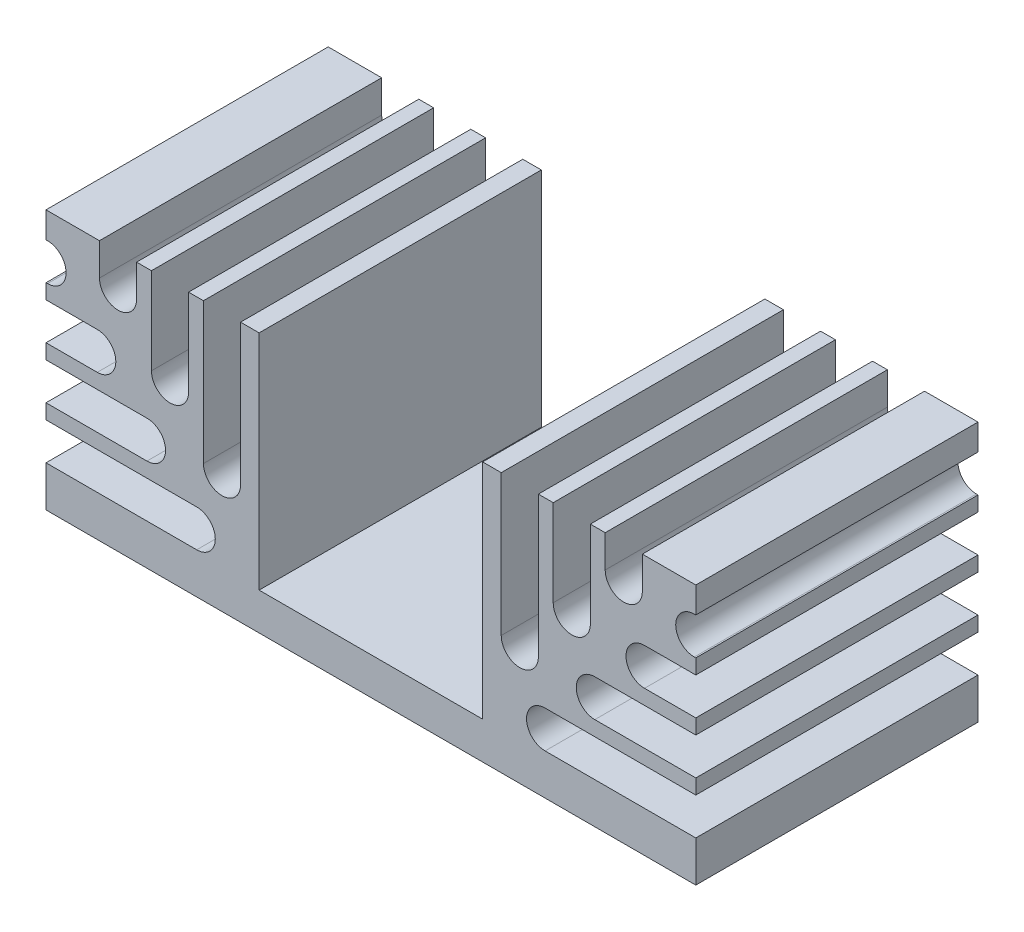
from build123d import *

# Parameters (mm, degrees)
SKICA1_W                 = 87.5
SKICA1_H                 = 35
P_IDAT_VYSUNUT_M1_DEPTH  = 38
SKICA3_W                 = 30.1
SKICA3_H                 = 30
ODEBRAT_VYSUNUT_M1_DEPTH = 67.288726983
M3X0_5_Z_VIT1_D          = 2.5
M3X0_5_Z_VIT1_DEPTH      = 8.5
M3X0_5_Z_VIT1_TIP        = 0.751075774


with BuildPart() as part:
    # Skica1 → P_idat vysunut_m1 (new body)
    with BuildSketch(Plane.XY):
        with Locations((6.420634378, -3.311121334)):
            Rectangle(SKICA1_W, SKICA1_H)
    extrude(amount=P_IDAT_VYSUNUT_M1_DEPTH)

    # Skica3 → Odebrat vysunut_m1 (cut, through all)
    with BuildSketch(Plane.XY.offset(38)):
        with BuildLine():
            Line((-18.129365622, 2.518822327), (-18.129365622, 14.188878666))
            Line((-18.129365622, 14.188878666), (-23.129365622, 14.188878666))
            Line((-23.129365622, 14.188878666), (-23.129365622, 2.518822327))
            ThreePointArc((-23.129365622, 2.518822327), (-20.629365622, 0.018822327), (-18.129365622, 2.518822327))
        make_face()
        with BuildLine():
            Line((-11.129365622, -4.798250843), (-11.129365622, 14.188878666))
            Line((-11.129365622, 14.188878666), (-16.129365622, 14.188878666))
            Line((-16.129365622, 14.188878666), (-16.129365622, -4.798250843))
            ThreePointArc((-16.129365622, -4.798250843), (-13.629365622, -7.298250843), (-11.129365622, -4.798250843))
        make_face()
        with Locations((6.420634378, -0.811121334)):
            Rectangle(SKICA3_W, SKICA3_H)
        with BuildLine():
            Line((-25.129365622, 9.835895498), (-25.129365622, 14.188878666))
            Line((-25.129365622, 14.188878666), (-30.129365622, 14.188878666))
            Line((-30.129365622, 14.188878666), (-30.129365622, 9.835895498))
            ThreePointArc((-30.129365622, 9.835895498), (-27.629365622, 7.335895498), (-25.129365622, 9.835895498))
        make_face()
        with BuildLine():
            Line((-37.125011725, 10.688878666), (-37.329365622, 10.688878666))
            Line((-37.329365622, 10.688878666), (-37.329365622, 5.688878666))
            Line((-37.329365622, 5.688878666), (-37.125011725, 5.688878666))
            ThreePointArc((-37.125011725, 5.688878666), (-34.625011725, 8.188878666), (-37.125011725, 10.688878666))
        make_face()
        with BuildLine():
            Line((-30.428345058, 3.688878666), (-37.329365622, 3.688878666))
            Line((-37.329365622, 3.688878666), (-37.329365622, -1.311121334))
            Line((-37.329365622, -1.311121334), (-30.428345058, -1.311121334))
            ThreePointArc((-30.428345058, -1.311121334), (-27.928345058, 1.188878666), (-30.428345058, 3.688878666))
        make_face()
        with BuildLine():
            Line((-17.035011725, -10.311121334), (-37.329365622, -10.311121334))
            Line((-37.329365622, -10.311121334), (-37.329365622, -15.311121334))
            Line((-37.329365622, -15.311121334), (-17.035011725, -15.311121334))
            ThreePointArc((-17.035011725, -15.311121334), (-14.535011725, -12.811121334), (-17.035011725, -10.311121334))
        make_face()
        with BuildLine():
            Line((50.170634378, 5.688878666), (50.170634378, 10.688878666))
            Line((50.170634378, 10.688878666), (49.966280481, 10.688878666))
            ThreePointArc((49.966280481, 10.688878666), (47.466280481, 8.188878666), (49.966280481, 5.688878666))
            Line((49.966280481, 5.688878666), (50.170634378, 5.688878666))
        make_face()
        with BuildLine():
            Line((42.970634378, 14.188878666), (37.970634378, 14.188878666))
            Line((37.970634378, 14.188878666), (37.970634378, 9.835895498))
            ThreePointArc((37.970634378, 9.835895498), (40.470634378, 7.335895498), (42.970634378, 9.835895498))
            Line((42.970634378, 9.835895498), (42.970634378, 14.188878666))
        make_face()
        with BuildLine():
            Line((35.970634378, 14.188878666), (30.970634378, 14.188878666))
            Line((30.970634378, 14.188878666), (30.970634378, 2.518822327))
            ThreePointArc((30.970634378, 2.518822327), (33.470634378, 0.018822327), (35.970634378, 2.518822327))
            Line((35.970634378, 2.518822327), (35.970634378, 14.188878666))
        make_face()
        with BuildLine():
            Line((28.970634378, 14.188878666), (23.970634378, 14.188878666))
            Line((23.970634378, 14.188878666), (23.970634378, -4.798250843))
            ThreePointArc((23.970634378, -4.798250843), (26.470634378, -7.298250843), (28.970634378, -4.798250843))
            Line((28.970634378, -4.798250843), (28.970634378, 14.188878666))
        make_face()
        with BuildLine():
            Line((50.170634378, -1.311121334), (50.170634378, 3.688878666))
            Line((50.170634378, 3.688878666), (43.269613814, 3.688878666))
            ThreePointArc((43.269613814, 3.688878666), (40.769613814, 1.188878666), (43.269613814, -1.311121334))
            Line((43.269613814, -1.311121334), (50.170634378, -1.311121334))
        make_face()
        with BuildLine():
            Line((50.170634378, -8.311121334), (50.170634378, -3.311121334))
            Line((50.170634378, -3.311121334), (36.572947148, -3.311121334))
            ThreePointArc((36.572947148, -3.311121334), (34.072947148, -5.811121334), (36.572947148, -8.311121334))
            Line((36.572947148, -8.311121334), (50.170634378, -8.311121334))
        make_face()
        with BuildLine():
            Line((50.170634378, -15.311121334), (50.170634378, -10.311121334))
            Line((50.170634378, -10.311121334), (29.876280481, -10.311121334))
            ThreePointArc((29.876280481, -10.311121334), (27.376280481, -12.811121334), (29.876280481, -15.311121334))
            Line((29.876280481, -15.311121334), (50.170634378, -15.311121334))
        make_face()
        with BuildLine():
            Line((-42.946707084, -3.311121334), (-23.731678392, -3.311121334))
            ThreePointArc((-23.731678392, -3.311121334), (-21.231678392, -5.811121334), (-23.731678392, -8.311121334))
            Line((-23.731678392, -8.311121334), (-42.946707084, -8.311121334))
            ThreePointArc((-42.946707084, -8.311121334), (-45.446707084, -5.811121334), (-42.946707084, -3.311121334))
        make_face()
    extrude(amount=-ODEBRAT_VYSUNUT_M1_DEPTH, mode=Mode.SUBTRACT)

    # M3x0.5 z_vit1
    with Locations(Plane(origin=(0, -20.811121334, 0), x_dir=(-1, 0, 0), z_dir=(0, -1, 0))):
        with Locations((17.329365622, -5), (-40.170634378, -5)):
            Hole(M3X0_5_Z_VIT1_D / 2, depth=M3X0_5_Z_VIT1_DEPTH)
            with Locations((0, 0, -(M3X0_5_Z_VIT1_DEPTH + M3X0_5_Z_VIT1_TIP / 2))):  # 118° drill point
                Cone(0, M3X0_5_Z_VIT1_D / 2, M3X0_5_Z_VIT1_TIP, mode=Mode.SUBTRACT)


solid = part.part
